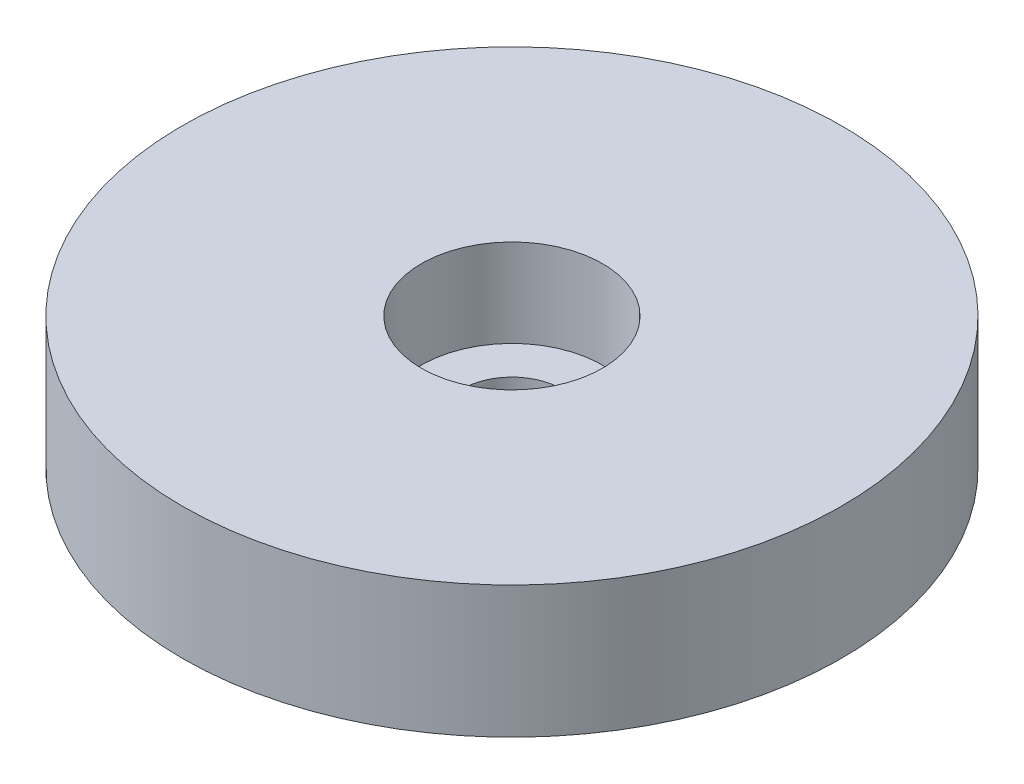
ISO-10303-21;
HEADER;
FILE_DESCRIPTION(('STEP AP214'),'2;1');
FILE_NAME('part.step','',(''),(''),'','','');
FILE_SCHEMA(('AUTOMOTIVE_DESIGN { 1 0 10303 214 1 1 1 1 }'));
ENDSEC;
DATA;
#1=APPLICATION_CONTEXT('core data for automotive mechanical design processes');
#2=APPLICATION_PROTOCOL_DEFINITION('international standard','automotive_design',2000,#1);
#3=PRODUCT_CONTEXT('',#1,'mechanical');
#4=PRODUCT('Part','Part','',(#3));
#5=PRODUCT_RELATED_PRODUCT_CATEGORY('part','',(#4));
#6=PRODUCT_DEFINITION_FORMATION('','',#4);
#7=PRODUCT_DEFINITION_CONTEXT('part definition',#1,'design');
#8=PRODUCT_DEFINITION('design','',#6,#7);
#9=PRODUCT_DEFINITION_SHAPE('','',#8);
#10=(LENGTH_UNIT() NAMED_UNIT(*) SI_UNIT(.MILLI.,.METRE.));
#11=(NAMED_UNIT(*) PLANE_ANGLE_UNIT() SI_UNIT($,.RADIAN.));
#12=(NAMED_UNIT(*) SI_UNIT($,.STERADIAN.) SOLID_ANGLE_UNIT());
#13=UNCERTAINTY_MEASURE_WITH_UNIT(LENGTH_MEASURE(1.E-05),#10,'distance_accuracy_value','');
#14=(GEOMETRIC_REPRESENTATION_CONTEXT(3) GLOBAL_UNCERTAINTY_ASSIGNED_CONTEXT((#13)) GLOBAL_UNIT_ASSIGNED_CONTEXT((#10,
#11,#12)) REPRESENTATION_CONTEXT('',''));
#15=CARTESIAN_POINT('',(0.,0.,0.));
#16=DIRECTION('',(0.,0.,1.));
#17=DIRECTION('',(1.,0.,0.));
#18=AXIS2_PLACEMENT_3D('',#15,#16,#17);
#19=CARTESIAN_POINT('',(0.,-6.,0.));
#20=DIRECTION('',(0.,1.,0.));
#21=DIRECTION('',(0.,0.,1.));
#22=AXIS2_PLACEMENT_3D('',#19,#20,#21);
#23=CYLINDRICAL_SURFACE('',#22,15.);
#24=CARTESIAN_POINT('',(0.,-6.,0.));
#25=DIRECTION('',(0.,1.,0.));
#26=DIRECTION('',(0.,0.,1.));
#27=AXIS2_PLACEMENT_3D('',#24,#25,#26);
#28=CIRCLE('',#27,15.);
#29=CARTESIAN_POINT('',(0.,-6.,15.));
#30=VERTEX_POINT('',#29);
#31=EDGE_CURVE('E10',#30,#30,#28,.T.);
#32=ORIENTED_EDGE('',*,*,#31,.T.);
#33=EDGE_LOOP('',(#32));
#34=FACE_BOUND('',#33,.T.);
#35=CARTESIAN_POINT('',(0.,0.,0.));
#36=DIRECTION('',(0.,1.,0.));
#37=DIRECTION('',(0.,0.,1.));
#38=AXIS2_PLACEMENT_3D('',#35,#36,#37);
#39=CIRCLE('',#38,15.);
#40=CARTESIAN_POINT('',(0.,0.,15.));
#41=VERTEX_POINT('',#40);
#42=EDGE_CURVE('E47',#41,#41,#39,.T.);
#43=ORIENTED_EDGE('',*,*,#42,.F.);
#44=EDGE_LOOP('',(#43));
#45=FACE_BOUND('',#44,.T.);
#46=ADVANCED_FACE('F39',(#34,#45),#23,.T.);
#47=CARTESIAN_POINT('',(0.,-6.,0.));
#48=DIRECTION('',(0.,1.,0.));
#49=DIRECTION('',(0.,0.,1.));
#50=AXIS2_PLACEMENT_3D('',#47,#48,#49);
#51=PLANE('',#50);
#52=CARTESIAN_POINT('',(0.,-6.,0.));
#53=DIRECTION('',(0.,1.,0.));
#54=DIRECTION('',(0.,0.,1.));
#55=AXIS2_PLACEMENT_3D('',#52,#53,#54);
#56=CIRCLE('',#55,5.);
#57=CARTESIAN_POINT('',(0.,-6.,5.));
#58=VERTEX_POINT('',#57);
#59=EDGE_CURVE('E53',#58,#58,#56,.T.);
#60=ORIENTED_EDGE('',*,*,#59,.T.);
#61=EDGE_LOOP('',(#60));
#62=FACE_BOUND('',#61,.T.);
#63=ORIENTED_EDGE('',*,*,#31,.F.);
#64=EDGE_LOOP('',(#63));
#65=FACE_BOUND('',#64,.T.);
#66=ADVANCED_FACE('F85',(#62,#65),#51,.F.);
#67=CARTESIAN_POINT('',(0.,0.,0.));
#68=DIRECTION('',(0.,1.,0.));
#69=DIRECTION('',(0.,0.,1.));
#70=AXIS2_PLACEMENT_3D('',#67,#68,#69);
#71=PLANE('',#70);
#72=CARTESIAN_POINT('',(0.,0.,0.));
#73=DIRECTION('',(0.,1.,0.));
#74=DIRECTION('',(0.,0.,1.));
#75=AXIS2_PLACEMENT_3D('',#72,#73,#74);
#76=CIRCLE('',#75,4.125);
#77=CARTESIAN_POINT('',(0.,0.,4.125));
#78=VERTEX_POINT('',#77);
#79=EDGE_CURVE('E59',#78,#78,#76,.T.);
#80=ORIENTED_EDGE('',*,*,#79,.F.);
#81=EDGE_LOOP('',(#80));
#82=FACE_BOUND('',#81,.T.);
#83=ORIENTED_EDGE('',*,*,#42,.T.);
#84=EDGE_LOOP('',(#83));
#85=FACE_BOUND('',#84,.T.);
#86=ADVANCED_FACE('F81',(#82,#85),#71,.T.);
#87=CARTESIAN_POINT('',(0.,-6.,0.));
#88=DIRECTION('',(0.,1.,0.));
#89=DIRECTION('',(0.,0.,1.));
#90=AXIS2_PLACEMENT_3D('',#87,#88,#89);
#91=SPHERICAL_SURFACE('',#90,5.);
#92=CARTESIAN_POINT('',(0.,-10.4651427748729,0.));
#93=DIRECTION('',(0.,1.,0.));
#94=DIRECTION('',(0.,0.,1.));
#95=AXIS2_PLACEMENT_3D('',#92,#93,#94);
#96=CIRCLE('',#95,2.25);
#97=CARTESIAN_POINT('',(0.,-10.4651427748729,2.25));
#98=VERTEX_POINT('',#97);
#99=EDGE_CURVE('E42',#98,#98,#96,.F.);
#100=ORIENTED_EDGE('',*,*,#99,.F.);
#101=EDGE_LOOP('',(#100));
#102=FACE_BOUND('',#101,.T.);
#103=ORIENTED_EDGE('',*,*,#59,.F.);
#104=EDGE_LOOP('',(#103));
#105=FACE_BOUND('',#104,.T.);
#106=ADVANCED_FACE('F77',(#102,#105),#91,.T.);
#107=CARTESIAN_POINT('',(0.,-4.,0.));
#108=DIRECTION('',(0.,1.,0.));
#109=DIRECTION('',(0.,0.,1.));
#110=AXIS2_PLACEMENT_3D('',#107,#108,#109);
#111=CYLINDRICAL_SURFACE('',#110,4.125);
#112=CARTESIAN_POINT('',(0.,-4.,0.));
#113=DIRECTION('',(0.,1.,0.));
#114=DIRECTION('',(0.,0.,1.));
#115=AXIS2_PLACEMENT_3D('',#112,#113,#114);
#116=CIRCLE('',#115,4.125);
#117=CARTESIAN_POINT('',(0.,-4.,4.125));
#118=VERTEX_POINT('',#117);
#119=EDGE_CURVE('E58',#118,#118,#116,.T.);
#120=ORIENTED_EDGE('',*,*,#119,.F.);
#121=EDGE_LOOP('',(#120));
#122=FACE_BOUND('',#121,.T.);
#123=ORIENTED_EDGE('',*,*,#79,.T.);
#124=EDGE_LOOP('',(#123));
#125=FACE_BOUND('',#124,.T.);
#126=ADVANCED_FACE('F80',(#122,#125),#111,.F.);
#127=CARTESIAN_POINT('',(0.,-4.,0.));
#128=DIRECTION('',(0.,1.,0.));
#129=DIRECTION('',(0.,0.,1.));
#130=AXIS2_PLACEMENT_3D('',#127,#128,#129);
#131=PLANE('',#130);
#132=CARTESIAN_POINT('',(0.,-4.,0.));
#133=DIRECTION('',(0.,1.,0.));
#134=DIRECTION('',(0.,0.,1.));
#135=AXIS2_PLACEMENT_3D('',#132,#133,#134);
#136=CIRCLE('',#135,2.25);
#137=CARTESIAN_POINT('',(0.,-4.,2.25));
#138=VERTEX_POINT('',#137);
#139=EDGE_CURVE('E66',#138,#138,#136,.T.);
#140=ORIENTED_EDGE('',*,*,#139,.F.);
#141=EDGE_LOOP('',(#140));
#142=FACE_BOUND('',#141,.T.);
#143=ORIENTED_EDGE('',*,*,#119,.T.);
#144=EDGE_LOOP('',(#143));
#145=FACE_BOUND('',#144,.T.);
#146=ADVANCED_FACE('F97',(#142,#145),#131,.T.);
#147=CARTESIAN_POINT('',(0.,-11.,0.));
#148=DIRECTION('',(0.,1.,0.));
#149=DIRECTION('',(0.,0.,1.));
#150=AXIS2_PLACEMENT_3D('',#147,#148,#149);
#151=CYLINDRICAL_SURFACE('',#150,2.25);
#152=CARTESIAN_POINT('',(0.,-10.4651427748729,2.25));
#153=CARTESIAN_POINT('',(0.,-10.3977975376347,2.25));
#154=CARTESIAN_POINT('',(0.,-10.3304523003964,2.25));
#155=CARTESIAN_POINT('',(0.,-10.1957618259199,2.25));
#156=CARTESIAN_POINT('',(0.,-10.1284165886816,2.25));
#157=CARTESIAN_POINT('',(0.,-9.99372611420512,2.25));
#158=CARTESIAN_POINT('',(0.,-9.92638087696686,2.25));
#159=CARTESIAN_POINT('',(0.,-9.79169040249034,2.25));
#160=CARTESIAN_POINT('',(0.,-9.72434516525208,2.25));
#161=CARTESIAN_POINT('',(0.,-9.58965469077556,2.25));
#162=CARTESIAN_POINT('',(0.,-9.5223094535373,2.25));
#163=CARTESIAN_POINT('',(0.,-9.38761897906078,2.25));
#164=CARTESIAN_POINT('',(0.,-9.32027374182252,2.25));
#165=CARTESIAN_POINT('',(0.,-9.185583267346,2.25));
#166=CARTESIAN_POINT('',(0.,-9.11823803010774,2.25));
#167=CARTESIAN_POINT('',(0.,-8.98354755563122,2.25));
#168=CARTESIAN_POINT('',(0.,-8.91620231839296,2.25));
#169=CARTESIAN_POINT('',(0.,-8.78151184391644,2.25));
#170=CARTESIAN_POINT('',(0.,-8.71416660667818,2.25));
#171=CARTESIAN_POINT('',(0.,-8.57947613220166,2.25));
#172=CARTESIAN_POINT('',(0.,-8.51213089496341,2.25));
#173=CARTESIAN_POINT('',(0.,-8.37744042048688,2.25));
#174=CARTESIAN_POINT('',(0.,-8.31009518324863,2.25));
#175=CARTESIAN_POINT('',(0.,-8.17540470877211,2.25));
#176=CARTESIAN_POINT('',(0.,-8.10805947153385,2.25));
#177=CARTESIAN_POINT('',(0.,-7.97336899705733,2.25));
#178=CARTESIAN_POINT('',(0.,-7.90602375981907,2.25));
#179=CARTESIAN_POINT('',(0.,-7.77133328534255,2.25));
#180=CARTESIAN_POINT('',(0.,-7.70398804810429,2.25));
#181=CARTESIAN_POINT('',(0.,-7.56929757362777,2.25));
#182=CARTESIAN_POINT('',(0.,-7.50195233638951,2.25));
#183=CARTESIAN_POINT('',(0.,-7.36726186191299,2.25));
#184=CARTESIAN_POINT('',(0.,-7.29991662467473,2.25));
#185=CARTESIAN_POINT('',(0.,-7.16522615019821,2.25));
#186=CARTESIAN_POINT('',(0.,-7.09788091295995,2.25));
#187=CARTESIAN_POINT('',(0.,-6.96319043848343,2.25));
#188=CARTESIAN_POINT('',(0.,-6.89584520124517,2.25));
#189=CARTESIAN_POINT('',(0.,-6.76115472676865,2.25));
#190=CARTESIAN_POINT('',(0.,-6.69380948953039,2.25));
#191=CARTESIAN_POINT('',(0.,-6.55911901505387,2.25));
#192=CARTESIAN_POINT('',(0.,-6.49177377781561,2.25));
#193=CARTESIAN_POINT('',(0.,-6.35708330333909,2.25));
#194=CARTESIAN_POINT('',(0.,-6.28973806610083,2.25));
#195=CARTESIAN_POINT('',(0.,-6.15504759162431,2.25));
#196=CARTESIAN_POINT('',(0.,-6.08770235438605,2.25));
#197=CARTESIAN_POINT('',(0.,-5.95301187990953,2.25));
#198=CARTESIAN_POINT('',(0.,-5.88566664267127,2.25));
#199=CARTESIAN_POINT('',(0.,-5.75097616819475,2.25));
#200=CARTESIAN_POINT('',(0.,-5.68363093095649,2.25));
#201=CARTESIAN_POINT('',(0.,-5.54894045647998,2.25));
#202=CARTESIAN_POINT('',(0.,-5.48159521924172,2.25));
#203=CARTESIAN_POINT('',(0.,-5.3469047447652,2.25));
#204=CARTESIAN_POINT('',(0.,-5.27955950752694,2.25));
#205=CARTESIAN_POINT('',(0.,-5.14486903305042,2.25));
#206=CARTESIAN_POINT('',(0.,-5.07752379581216,2.25));
#207=CARTESIAN_POINT('',(0.,-4.94283332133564,2.25));
#208=CARTESIAN_POINT('',(0.,-4.87548808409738,2.25));
#209=CARTESIAN_POINT('',(0.,-4.74079760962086,2.25));
#210=CARTESIAN_POINT('',(0.,-4.6734523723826,2.25));
#211=CARTESIAN_POINT('',(0.,-4.53876189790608,2.25));
#212=CARTESIAN_POINT('',(0.,-4.47141666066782,2.25));
#213=CARTESIAN_POINT('',(0.,-4.3367261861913,2.25));
#214=CARTESIAN_POINT('',(0.,-4.26938094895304,2.25));
#215=CARTESIAN_POINT('',(0.,-4.13469047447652,2.25));
#216=CARTESIAN_POINT('',(0.,-4.06734523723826,2.25));
#217=CARTESIAN_POINT('',(0.,-4.,2.25));
#218=B_SPLINE_CURVE_WITH_KNOTS('',3,(#152,#153,#154,#155,#156,#157,#158,#159,#160,#161,#162,
#163,#164,#165,#166,#167,#168,#169,#170,#171,#172,#173,#174,#175,#176,#177,#178,#179,#180,#181,
#182,#183,#184,#185,#186,#187,#188,#189,#190,#191,#192,#193,#194,#195,#196,#197,#198,#199,#200,
#201,#202,#203,#204,#205,#206,#207,#208,#209,#210,#211,#212,#213,#214,#215,#216,#217),
.UNSPECIFIED.,.F.,.F.,(4,2,2,2,2,2,2,2,2,2,2,2,2,2,2,2,2,2,2,2,2,2,2,2,2,2,2,2,2,2,2,2,4),(0.,
0.202035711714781,0.404071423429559,0.606107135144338,0.808142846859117,1.0101785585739,
1.21221427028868,1.41424998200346,1.61628569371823,1.81832140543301,2.02035711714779,
2.22239282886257,2.42442854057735,2.62646425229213,2.82849996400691,3.03053567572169,
3.23257138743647,3.43460709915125,3.63664281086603,3.83867852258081,4.04071423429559,
4.24274994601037,4.44478565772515,4.64682136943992,4.8488570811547,5.05089279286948,
5.25292850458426,5.45496421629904,5.65699992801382,5.8590356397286,6.06107135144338,
6.26310706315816,6.46514277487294),.UNSPECIFIED.);
#219=EDGE_CURVE('BSEAM75',#98,#138,#218,.T.);
#220=ORIENTED_EDGE('',*,*,#99,.T.);
#221=ORIENTED_EDGE('',*,*,#139,.T.);
#222=ORIENTED_EDGE('',*,*,#219,.T.);
#223=ORIENTED_EDGE('',*,*,#219,.F.);
#224=EDGE_LOOP('',(#220,#222,#221,#223));
#225=FACE_BOUND('',#224,.T.);
#226=ADVANCED_FACE('F75',(#225),#151,.F.);
#227=CLOSED_SHELL('',(#46,#66,#86,#106,#126,#146,#226));
#228=MANIFOLD_SOLID_BREP('B2',#227);
#229=ADVANCED_BREP_SHAPE_REPRESENTATION('',(#18,#228),#14);
#230=SHAPE_DEFINITION_REPRESENTATION(#9,#229);
ENDSEC;
END-ISO-10303-21;
